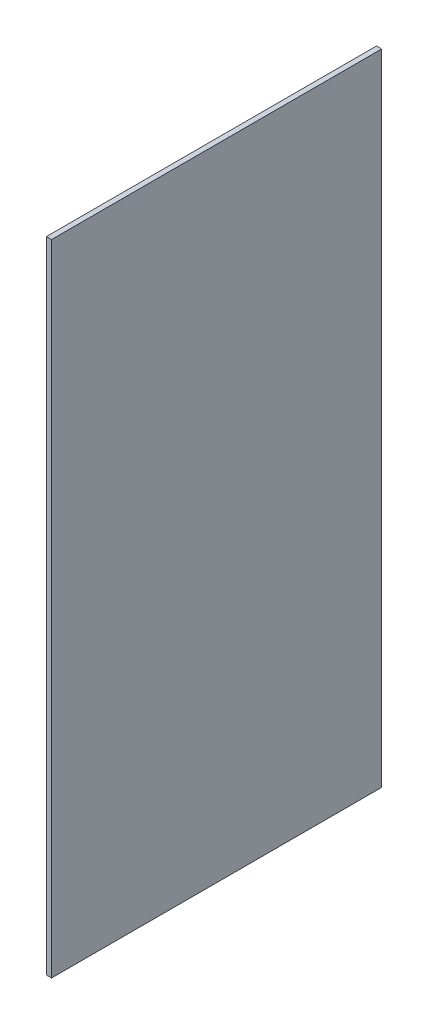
ISO-10303-21;
HEADER;
FILE_DESCRIPTION(('STEP AP214'),'2;1');
FILE_NAME('part.step','',(''),(''),'','','');
FILE_SCHEMA(('AUTOMOTIVE_DESIGN { 1 0 10303 214 1 1 1 1 }'));
ENDSEC;
DATA;
#1=APPLICATION_CONTEXT('core data for automotive mechanical design processes');
#2=APPLICATION_PROTOCOL_DEFINITION('international standard','automotive_design',2000,#1);
#3=PRODUCT_CONTEXT('',#1,'mechanical');
#4=PRODUCT('Part','Part','',(#3));
#5=PRODUCT_RELATED_PRODUCT_CATEGORY('part','',(#4));
#6=PRODUCT_DEFINITION_FORMATION('','',#4);
#7=PRODUCT_DEFINITION_CONTEXT('part definition',#1,'design');
#8=PRODUCT_DEFINITION('design','',#6,#7);
#9=PRODUCT_DEFINITION_SHAPE('','',#8);
#10=(LENGTH_UNIT() NAMED_UNIT(*) SI_UNIT(.MILLI.,.METRE.));
#11=(NAMED_UNIT(*) PLANE_ANGLE_UNIT() SI_UNIT($,.RADIAN.));
#12=(NAMED_UNIT(*) SI_UNIT($,.STERADIAN.) SOLID_ANGLE_UNIT());
#13=UNCERTAINTY_MEASURE_WITH_UNIT(LENGTH_MEASURE(1.E-05),#10,'distance_accuracy_value','');
#14=(GEOMETRIC_REPRESENTATION_CONTEXT(3) GLOBAL_UNCERTAINTY_ASSIGNED_CONTEXT((#13)) GLOBAL_UNIT_ASSIGNED_CONTEXT((#10,
#11,#12)) REPRESENTATION_CONTEXT('',''));
#15=CARTESIAN_POINT('',(0.,0.,0.));
#16=DIRECTION('',(0.,0.,1.));
#17=DIRECTION('',(1.,0.,0.));
#18=AXIS2_PLACEMENT_3D('',#15,#16,#17);
#19=CARTESIAN_POINT('',(-4.76249999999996,1181.1,304.8));
#20=DIRECTION('',(1.,0.,0.));
#21=DIRECTION('',(0.,0.,-1.));
#22=AXIS2_PLACEMENT_3D('',#19,#20,#21);
#23=PLANE('',#22);
#24=DIRECTION('',(0.,0.,1.));
#25=VECTOR('',#24,1.);
#26=CARTESIAN_POINT('',(-4.76249999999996,0.,304.8));
#27=LINE('',#26,#25);
#28=CARTESIAN_POINT('',(-4.76250000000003,0.,-304.8));
#29=VERTEX_POINT('',#28);
#30=CARTESIAN_POINT('',(-4.76249999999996,0.,304.8));
#31=VERTEX_POINT('',#30);
#32=EDGE_CURVE('E113',#29,#31,#27,.T.);
#33=ORIENTED_EDGE('',*,*,#32,.T.);
#34=DIRECTION('',(0.,-1.,0.));
#35=VECTOR('',#34,1.);
#36=CARTESIAN_POINT('',(-4.76249999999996,1181.1,304.8));
#37=LINE('',#36,#35);
#38=CARTESIAN_POINT('',(-4.76249999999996,1181.1,304.8));
#39=VERTEX_POINT('',#38);
#40=EDGE_CURVE('E11',#39,#31,#37,.T.);
#41=ORIENTED_EDGE('',*,*,#40,.F.);
#42=DIRECTION('',(0.,0.,1.));
#43=VECTOR('',#42,1.);
#44=CARTESIAN_POINT('',(-4.76249999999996,1181.1,304.8));
#45=LINE('',#44,#43);
#46=CARTESIAN_POINT('',(-4.76250000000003,1181.1,-304.8));
#47=VERTEX_POINT('',#46);
#48=EDGE_CURVE('E97',#47,#39,#45,.T.);
#49=ORIENTED_EDGE('',*,*,#48,.F.);
#50=DIRECTION('',(0.,-1.,0.));
#51=VECTOR('',#50,1.);
#52=CARTESIAN_POINT('',(-4.76250000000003,1181.1,-304.8));
#53=LINE('',#52,#51);
#54=EDGE_CURVE('E107',#47,#29,#53,.T.);
#55=ORIENTED_EDGE('',*,*,#54,.T.);
#56=EDGE_LOOP('',(#33,#41,#49,#55));
#57=FACE_BOUND('',#56,.T.);
#58=ADVANCED_FACE('F44',(#57),#23,.F.);
#59=CARTESIAN_POINT('',(4.76250000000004,1181.1,304.8));
#60=DIRECTION('',(0.,0.,-1.));
#61=DIRECTION('',(-1.,0.,0.));
#62=AXIS2_PLACEMENT_3D('',#59,#60,#61);
#63=PLANE('',#62);
#64=DIRECTION('',(1.,0.,0.));
#65=VECTOR('',#64,1.);
#66=CARTESIAN_POINT('',(4.76250000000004,0.,304.8));
#67=LINE('',#66,#65);
#68=CARTESIAN_POINT('',(4.76250000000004,0.,304.8));
#69=VERTEX_POINT('',#68);
#70=EDGE_CURVE('E105',#31,#69,#67,.T.);
#71=ORIENTED_EDGE('',*,*,#70,.T.);
#72=DIRECTION('',(0.,-1.,0.));
#73=VECTOR('',#72,1.);
#74=CARTESIAN_POINT('',(4.76250000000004,1181.1,304.8));
#75=LINE('',#74,#73);
#76=CARTESIAN_POINT('',(4.76250000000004,1181.1,304.8));
#77=VERTEX_POINT('',#76);
#78=EDGE_CURVE('E53',#77,#69,#75,.T.);
#79=ORIENTED_EDGE('',*,*,#78,.F.);
#80=DIRECTION('',(1.,0.,0.));
#81=VECTOR('',#80,1.);
#82=CARTESIAN_POINT('',(4.76250000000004,1181.1,304.8));
#83=LINE('',#82,#81);
#84=EDGE_CURVE('E95',#39,#77,#83,.T.);
#85=ORIENTED_EDGE('',*,*,#84,.F.);
#86=ORIENTED_EDGE('',*,*,#40,.T.);
#87=EDGE_LOOP('',(#71,#79,#85,#86));
#88=FACE_BOUND('',#87,.T.);
#89=ADVANCED_FACE('F103',(#88),#63,.F.);
#90=CARTESIAN_POINT('',(4.76250000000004,1181.1,304.8));
#91=DIRECTION('',(-1.,0.,0.));
#92=DIRECTION('',(0.,0.,1.));
#93=AXIS2_PLACEMENT_3D('',#90,#91,#92);
#94=PLANE('',#93);
#95=DIRECTION('',(0.,0.,-1.));
#96=VECTOR('',#95,1.);
#97=CARTESIAN_POINT('',(4.76250000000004,0.,304.8));
#98=LINE('',#97,#96);
#99=CARTESIAN_POINT('',(4.76249999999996,0.,-304.8));
#100=VERTEX_POINT('',#99);
#101=EDGE_CURVE('E79',#69,#100,#98,.T.);
#102=ORIENTED_EDGE('',*,*,#101,.T.);
#103=DIRECTION('',(0.,-1.,0.));
#104=VECTOR('',#103,1.);
#105=CARTESIAN_POINT('',(4.76249999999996,1181.1,-304.8));
#106=LINE('',#105,#104);
#107=CARTESIAN_POINT('',(4.76249999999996,1181.1,-304.8));
#108=VERTEX_POINT('',#107);
#109=EDGE_CURVE('E104',#108,#100,#106,.T.);
#110=ORIENTED_EDGE('',*,*,#109,.F.);
#111=DIRECTION('',(0.,0.,-1.));
#112=VECTOR('',#111,1.);
#113=CARTESIAN_POINT('',(4.76250000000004,1181.1,304.8));
#114=LINE('',#113,#112);
#115=EDGE_CURVE('E93',#77,#108,#114,.T.);
#116=ORIENTED_EDGE('',*,*,#115,.F.);
#117=ORIENTED_EDGE('',*,*,#78,.T.);
#118=EDGE_LOOP('',(#102,#110,#116,#117));
#119=FACE_BOUND('',#118,.T.);
#120=ADVANCED_FACE('F102',(#119),#94,.F.);
#121=CARTESIAN_POINT('',(4.76249999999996,1181.1,-304.8));
#122=DIRECTION('',(0.,0.,1.));
#123=DIRECTION('',(1.,0.,0.));
#124=AXIS2_PLACEMENT_3D('',#121,#122,#123);
#125=PLANE('',#124);
#126=DIRECTION('',(-1.,0.,0.));
#127=VECTOR('',#126,1.);
#128=CARTESIAN_POINT('',(4.76249999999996,0.,-304.8));
#129=LINE('',#128,#127);
#130=EDGE_CURVE('E83',#100,#29,#129,.T.);
#131=ORIENTED_EDGE('',*,*,#130,.T.);
#132=ORIENTED_EDGE('',*,*,#54,.F.);
#133=DIRECTION('',(-1.,0.,0.));
#134=VECTOR('',#133,1.);
#135=CARTESIAN_POINT('',(4.76249999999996,1181.1,-304.8));
#136=LINE('',#135,#134);
#137=EDGE_CURVE('E65',#108,#47,#136,.T.);
#138=ORIENTED_EDGE('',*,*,#137,.F.);
#139=ORIENTED_EDGE('',*,*,#109,.T.);
#140=EDGE_LOOP('',(#131,#132,#138,#139));
#141=FACE_BOUND('',#140,.T.);
#142=ADVANCED_FACE('F127',(#141),#125,.F.);
#143=CARTESIAN_POINT('',(0.,1181.1,0.));
#144=DIRECTION('',(0.,1.,0.));
#145=DIRECTION('',(0.,0.,1.));
#146=AXIS2_PLACEMENT_3D('',#143,#144,#145);
#147=PLANE('',#146);
#148=ORIENTED_EDGE('',*,*,#48,.T.);
#149=ORIENTED_EDGE('',*,*,#84,.T.);
#150=ORIENTED_EDGE('',*,*,#115,.T.);
#151=ORIENTED_EDGE('',*,*,#137,.T.);
#152=EDGE_LOOP('',(#148,#149,#150,#151));
#153=FACE_BOUND('',#152,.T.);
#154=ADVANCED_FACE('F94',(#153),#147,.T.);
#155=CARTESIAN_POINT('',(0.,0.,0.));
#156=DIRECTION('',(0.,1.,0.));
#157=DIRECTION('',(0.,0.,1.));
#158=AXIS2_PLACEMENT_3D('',#155,#156,#157);
#159=PLANE('',#158);
#160=ORIENTED_EDGE('',*,*,#32,.F.);
#161=ORIENTED_EDGE('',*,*,#130,.F.);
#162=ORIENTED_EDGE('',*,*,#101,.F.);
#163=ORIENTED_EDGE('',*,*,#70,.F.);
#164=EDGE_LOOP('',(#160,#161,#162,#163));
#165=FACE_BOUND('',#164,.T.);
#166=ADVANCED_FACE('F126',(#165),#159,.F.);
#167=CLOSED_SHELL('',(#58,#89,#120,#142,#154,#166));
#168=MANIFOLD_SOLID_BREP('B2',#167);
#169=ADVANCED_BREP_SHAPE_REPRESENTATION('',(#18,#168),#14);
#170=SHAPE_DEFINITION_REPRESENTATION(#9,#169);
ENDSEC;
END-ISO-10303-21;
